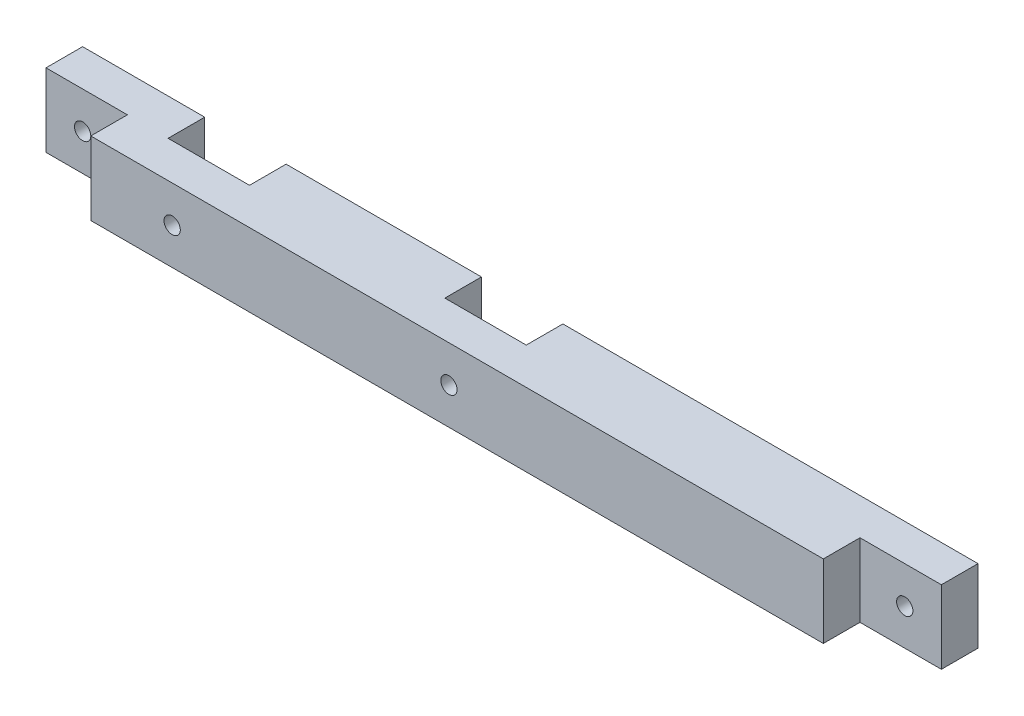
from build123d import *

# Parameters (mm, degrees)
ESQUISSE1_W             = 110
ESQUISSE1_H             = 9
EXTRUSION1_DEPTH        = 9
ESQUISSE2_W             = 10
ESQUISSE2_H             = 9
ENL_V_MAT_EXTRU_1_DEPTH = 4.5
ESQUISSE4_R             = 1
ENL_V_MAT_EXTRU_2_DEPTH = 4.5
ESQUISSE5_R             = 1
ENL_V_MAT_EXTRU_3_DEPTH = 4.5
ESQUISSE6_W             = 10
ESQUISSE6_H             = 9
ENL_V_MAT_EXTRU_4_DEPTH = 4.5
ESQUISSE7_R             = 1
ENL_V_MAT_EXTRU_5_DEPTH = 4.5
ESQUISSE8_W             = 10
ESQUISSE8_H             = 9
ENL_V_MAT_EXTRU_6_DEPTH = 4.5
ESQUISSE9_R             = 1
ENL_V_MAT_EXTRU_7_DEPTH = 4.5


with BuildPart() as part:
    # Esquisse1 → Extrusion1 (new body)
    with BuildSketch(Plane.XY):
        with Locations((-12.271684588, -105.117562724)):
            Rectangle(ESQUISSE1_W, ESQUISSE1_H)
    extrude(amount=EXTRUSION1_DEPTH)

    # Esquisse2 → Enl_v. mat.-Extru.1 (cut)
    with BuildSketch(Plane.XY.offset(9)):
        with Locations((-62.271684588, -105.117562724)):
            Rectangle(ESQUISSE2_W, ESQUISSE2_H)
        with Locations((37.728315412, -105.117562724)):
            Rectangle(ESQUISSE2_W, ESQUISSE2_H)
    extrude(amount=-ENL_V_MAT_EXTRU_1_DEPTH, mode=Mode.SUBTRACT)

    # Esquisse4 → Enl_v. mat.-Extru.2 (cut)
    with BuildSketch(Plane.XY.offset(4.5)):
        with Locations((38.22840174, -105.145436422)):
            Circle(ESQUISSE4_R)
    extrude(amount=-ENL_V_MAT_EXTRU_2_DEPTH, mode=Mode.SUBTRACT)

    # Esquisse5 → Enl_v. mat.-Extru.3 (cut)
    with BuildSketch(Plane.XY.offset(4.5)):
        with Locations((-62.771684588, -105.117562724)):
            Circle(ESQUISSE5_R)
    extrude(amount=-ENL_V_MAT_EXTRU_3_DEPTH, mode=Mode.SUBTRACT)

    # Esquisse6 → Enl_v. mat.-Extru.4 (cut)
    with BuildSketch(Plane(origin=(0, 0, 0), x_dir=(-1, 0, 0), z_dir=(0, 0, -1))):
        with Locations((47.271684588, -105.117562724)):
            Rectangle(ESQUISSE6_W, ESQUISSE6_H)
    extrude(amount=-ENL_V_MAT_EXTRU_4_DEPTH, mode=Mode.SUBTRACT)

    # Esquisse7 → Enl_v. mat.-Extru.5 (cut)
    with BuildSketch(Plane(origin=(0, 0, 4.5), x_dir=(-1, 0, 0), z_dir=(0, 0, -1))):
        with Locations((47.271684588, -105.117562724)):
            Circle(ESQUISSE7_R)
    extrude(amount=-ENL_V_MAT_EXTRU_5_DEPTH, mode=Mode.SUBTRACT)

    # Esquisse8 → Enl_v. mat.-Extru.6 (cut)
    with BuildSketch(Plane(origin=(0, 0, 0), x_dir=(-1, 0, 0), z_dir=(0, 0, -1))):
        with Locations((13.271684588, -105.117562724)):
            Rectangle(ESQUISSE8_W, ESQUISSE8_H)
    extrude(amount=-ENL_V_MAT_EXTRU_6_DEPTH, mode=Mode.SUBTRACT)

    # Esquisse9 → Enl_v. mat.-Extru.7 (cut)
    with BuildSketch(Plane(origin=(0, 0, 4.5), x_dir=(-1, 0, 0), z_dir=(0, 0, -1))):
        with Locations((13.271684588, -105.117562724)):
            Circle(ESQUISSE9_R)
    extrude(amount=-ENL_V_MAT_EXTRU_7_DEPTH, mode=Mode.SUBTRACT)


solid = part.part
